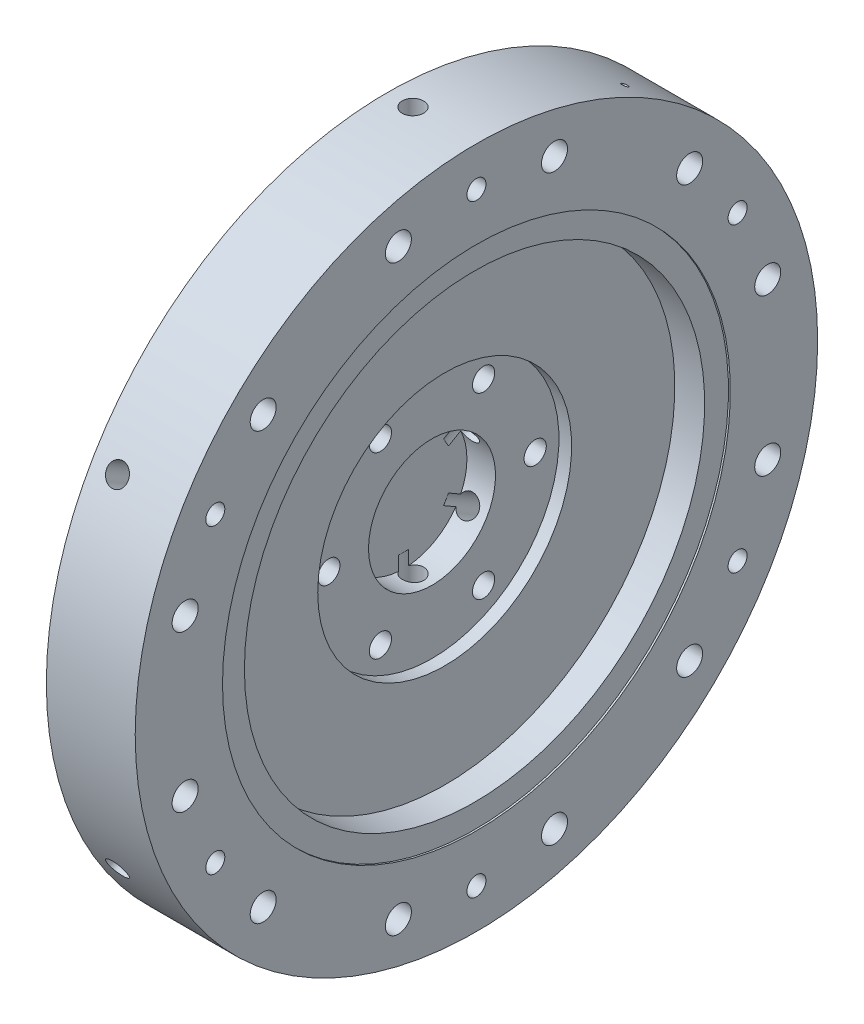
from build123d import *

# Parameters (mm, degrees)
CHAMBRAGE_POUR_VIS_T_TE_HEXAGONALE_M81_D           = 8.2
CHAMBRAGE_POUR_VIS_T_TE_HEXAGONALE_M81_CBORE_D     = 15
CHAMBRAGE_POUR_VIS_T_TE_HEXAGONALE_M81_CBORE_DEPTH = 8
R_P_TITION_CIRCULAIRE1_COUNT                       = 12
CHAMBRAGE_POUR_VIS_T_TE_HEXAGONALE_M61_D           = 7
CHAMBRAGE_POUR_VIS_T_TE_HEXAGONALE_M61_CBORE_D     = 11
CHAMBRAGE_POUR_VIS_T_TE_HEXAGONALE_M61_CBORE_DEPTH = 6
R_P_TITION_CIRCULAIRE2_COUNT                       = 6
ESQUISSE7_R                                        = 3.375
ENL_V_MAT_EXTRU_2_DEPTH                            = 92
ENL_V_START                                        = -10
ESQUISSE8_R                                        = 3
ENL_V_MAT_EXTRU_4_DEPTH                            = 22
R_P_TITION_CIRCULAIRE3_COUNT                       = 6
ESQUISSE9_R                                        = 1
ENL_V_MAT_EXTRU_5_DEPTH                            = 37


with BuildPart() as part:
    # Esquisse1 → R_volution1 (revolve)
    with BuildSketch(Plane.XY, mode=Mode.PRIVATE) as r_volution1_sk:
        Polygon((0, 0), (0, 107.5), (28, 107.5), (28, 80), (27.4, 80), (27.4, 72.5), (18, 72.5), (18, 40), (14, 40), (14, 20), (5, 20), (5, 0), align=None)
    revolve(r_volution1_sk.sketch.rotate(Axis((0, 0, 0), (1, 0, 0)), 90), axis=Axis((0, 0, 0), (1, 0, 0)))

    # Chambrage pour vis _ t_te hexagonale M81 (through all)
    with Locations(Plane.ZY):
        with Locations((-24.587809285, 91.762953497)):
            chambrage_pour_vis_t_te_hexagonale_m81 = CounterBoreHole(CHAMBRAGE_POUR_VIS_T_TE_HEXAGONALE_M81_D / 2, CHAMBRAGE_POUR_VIS_T_TE_HEXAGONALE_M81_CBORE_D / 2, CHAMBRAGE_POUR_VIS_T_TE_HEXAGONALE_M81_CBORE_DEPTH)

    # R_p_tition circulaire1: Chambrage pour vis _ t_te hexagonale M81 ×12 about axis
    r_p_tition_circulaire1_axis = Axis((0, 0, 0), (1, 0, 0))
    for i in range(1, R_P_TITION_CIRCULAIRE1_COUNT):
        add(chambrage_pour_vis_t_te_hexagonale_m81.rotate(r_p_tition_circulaire1_axis, i * 360 / R_P_TITION_CIRCULAIRE1_COUNT), mode=Mode.SUBTRACT)

    # Chambrage pour vis _ t_te hexagonale M61 (through all)
    with Locations(Plane.ZY):
        with Locations((16.25, -28.145825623)):
            chambrage_pour_vis_t_te_hexagonale_m61 = CounterBoreHole(CHAMBRAGE_POUR_VIS_T_TE_HEXAGONALE_M61_D / 2, CHAMBRAGE_POUR_VIS_T_TE_HEXAGONALE_M61_CBORE_D / 2, CHAMBRAGE_POUR_VIS_T_TE_HEXAGONALE_M61_CBORE_DEPTH)

    # R_p_tition circulaire2: Chambrage pour vis _ t_te hexagonale M61 ×6 about axis
    r_p_tition_circulaire2_axis = Axis((0, 0, 0), (1, 0, 0))
    for i in range(1, R_P_TITION_CIRCULAIRE2_COUNT):
        add(chambrage_pour_vis_t_te_hexagonale_m61.rotate(r_p_tition_circulaire2_axis, i * 360 / R_P_TITION_CIRCULAIRE2_COUNT), mode=Mode.SUBTRACT)

    # Esquisse7 → Enl_v. mat.-Extru.2 (cut)
    with BuildSketch(Plane(origin=(0, 107.5, 0), x_dir=(-1, 0, 0), z_dir=(0, 1, 0))):
        with Locations(Location((-8, 0, 0), (0, 0, 90))):
            Circle(ESQUISSE7_R)
    enl_v_mat_extru_2 = extrude(amount=-ENL_V_MAT_EXTRU_2_DEPTH, mode=Mode.SUBTRACT)

    # Esquisse8 → Enl_v. mat.-Extru.4 (cut)
    with BuildSketch(Plane(origin=(18, 0, 0), x_dir=(0, 0, -1), z_dir=(1, 0, 0)).offset(ENL_V_START)):
        with Locations((0, 95)):
            Circle(ESQUISSE8_R)
    enl_v_mat_extru_4 = extrude(amount=ENL_V_MAT_EXTRU_4_DEPTH, mode=Mode.SUBTRACT)

    # R_p_tition circulaire3: Enl_v. mat.-Extru.2, Enl_v. mat.-Extru.4 ×6 about axis
    r_p_tition_circulaire3_axis = Axis((0, 0, 0), (1, 0, 0))
    add([enl_v_mat_extru_2.rotate(r_p_tition_circulaire3_axis, i * 360 / R_P_TITION_CIRCULAIRE3_COUNT) for i in range(1, R_P_TITION_CIRCULAIRE3_COUNT)], mode=Mode.SUBTRACT)
    add([enl_v_mat_extru_4.rotate(r_p_tition_circulaire3_axis, i * 360 / R_P_TITION_CIRCULAIRE3_COUNT) for i in range(1, R_P_TITION_CIRCULAIRE3_COUNT)], mode=Mode.SUBTRACT)

    # Esquisse9 → Enl_v. mat.-Extru.5 (cut)
    with BuildSketch(Plane(origin=(0, 93.097730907, -53.75), x_dir=(1, 0, 0), z_dir=(0, -0.866025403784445, 0.499999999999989))):
        with Locations(Location((21, 0, 0), (0, 0, 90))):
            Circle(ESQUISSE9_R)
    extrude(amount=ENL_V_MAT_EXTRU_5_DEPTH, mode=Mode.SUBTRACT)


solid = part.part
